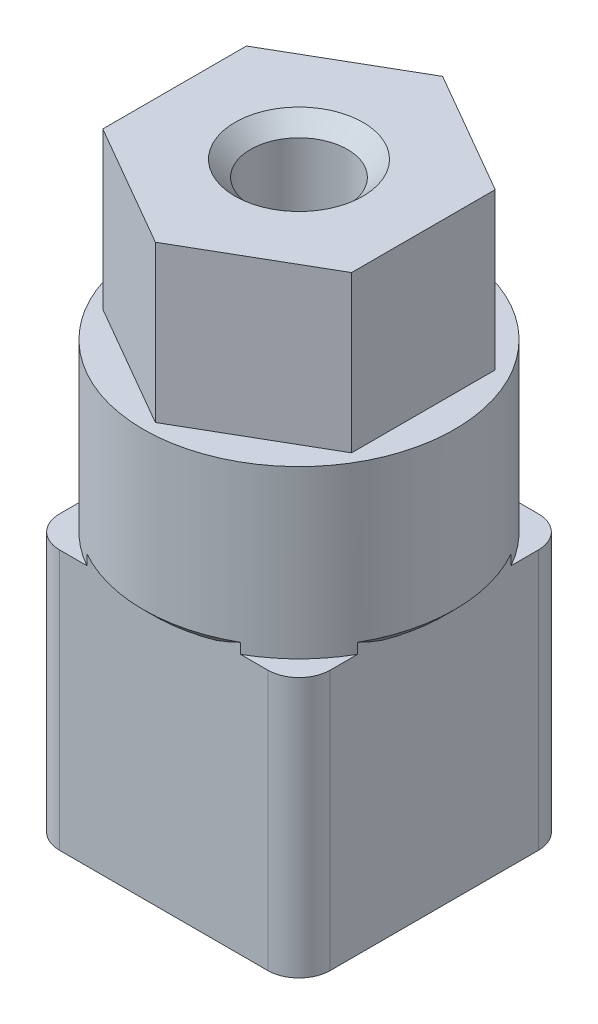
ISO-10303-21;
HEADER;
FILE_DESCRIPTION(('STEP AP214'),'2;1');
FILE_NAME('part.step','',(''),(''),'','','');
FILE_SCHEMA(('AUTOMOTIVE_DESIGN { 1 0 10303 214 1 1 1 1 }'));
ENDSEC;
DATA;
#1=APPLICATION_CONTEXT('core data for automotive mechanical design processes');
#2=APPLICATION_PROTOCOL_DEFINITION('international standard','automotive_design',2000,#1);
#3=PRODUCT_CONTEXT('',#1,'mechanical');
#4=PRODUCT('Part','Part','',(#3));
#5=PRODUCT_RELATED_PRODUCT_CATEGORY('part','',(#4));
#6=PRODUCT_DEFINITION_FORMATION('','',#4);
#7=PRODUCT_DEFINITION_CONTEXT('part definition',#1,'design');
#8=PRODUCT_DEFINITION('design','',#6,#7);
#9=PRODUCT_DEFINITION_SHAPE('','',#8);
#10=(LENGTH_UNIT() NAMED_UNIT(*) SI_UNIT(.MILLI.,.METRE.));
#11=(NAMED_UNIT(*) PLANE_ANGLE_UNIT() SI_UNIT($,.RADIAN.));
#12=(NAMED_UNIT(*) SI_UNIT($,.STERADIAN.) SOLID_ANGLE_UNIT());
#13=UNCERTAINTY_MEASURE_WITH_UNIT(LENGTH_MEASURE(1.E-05),#10,'distance_accuracy_value','');
#14=(GEOMETRIC_REPRESENTATION_CONTEXT(3) GLOBAL_UNCERTAINTY_ASSIGNED_CONTEXT((#13)) GLOBAL_UNIT_ASSIGNED_CONTEXT((#10,
#11,#12)) REPRESENTATION_CONTEXT('',''));
#15=CARTESIAN_POINT('',(0.,0.,0.));
#16=DIRECTION('',(0.,0.,1.));
#17=DIRECTION('',(1.,0.,0.));
#18=AXIS2_PLACEMENT_3D('',#15,#16,#17);
#19=CARTESIAN_POINT('',(0.,41.,0.));
#20=DIRECTION('',(0.,1.,0.));
#21=DIRECTION('',(0.,0.,1.));
#22=AXIS2_PLACEMENT_3D('',#19,#20,#21);
#23=PLANE('',#22);
#24=CARTESIAN_POINT('',(0.,41.,0.));
#25=DIRECTION('',(0.,1.,0.));
#26=DIRECTION('',(0.,0.,1.));
#27=AXIS2_PLACEMENT_3D('',#24,#25,#26);
#28=CIRCLE('',#27,14.95);
#29=CARTESIAN_POINT('',(0.,41.,14.95));
#30=VERTEX_POINT('',#29);
#31=EDGE_CURVE('E248',#30,#30,#28,.T.);
#32=ORIENTED_EDGE('',*,*,#31,.T.);
#33=EDGE_LOOP('',(#32));
#34=FACE_BOUND('',#33,.T.);
#35=DIRECTION('',(-0.866025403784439,0.,0.5));
#36=VECTOR('',#35,1.);
#37=CARTESIAN_POINT('',(0.,41.,-13.7986714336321));
#38=LINE('',#37,#36);
#39=CARTESIAN_POINT('',(0.,41.,-13.7986714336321));
#40=VERTEX_POINT('',#39);
#41=CARTESIAN_POINT('',(-11.95,41.,-6.89933571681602));
#42=VERTEX_POINT('',#41);
#43=EDGE_CURVE('E639',#40,#42,#38,.T.);
#44=ORIENTED_EDGE('',*,*,#43,.F.);
#45=DIRECTION('',(-0.866025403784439,0.,-0.5));
#46=VECTOR('',#45,1.);
#47=CARTESIAN_POINT('',(11.95,41.,-6.89933571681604));
#48=LINE('',#47,#46);
#49=CARTESIAN_POINT('',(11.95,41.,-6.89933571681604));
#50=VERTEX_POINT('',#49);
#51=EDGE_CURVE('E240',#50,#40,#48,.T.);
#52=ORIENTED_EDGE('',*,*,#51,.F.);
#53=DIRECTION('',(0.,0.,-1.));
#54=VECTOR('',#53,1.);
#55=CARTESIAN_POINT('',(11.95,41.,6.89933571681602));
#56=LINE('',#55,#54);
#57=CARTESIAN_POINT('',(11.95,41.,6.89933571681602));
#58=VERTEX_POINT('',#57);
#59=EDGE_CURVE('E236',#58,#50,#56,.T.);
#60=ORIENTED_EDGE('',*,*,#59,.F.);
#61=DIRECTION('',(0.866025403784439,0.,-0.5));
#62=VECTOR('',#61,1.);
#63=CARTESIAN_POINT('',(0.,41.,13.798671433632));
#64=LINE('',#63,#62);
#65=CARTESIAN_POINT('',(0.,41.,13.798671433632));
#66=VERTEX_POINT('',#65);
#67=EDGE_CURVE('E666',#66,#58,#64,.T.);
#68=ORIENTED_EDGE('',*,*,#67,.F.);
#69=DIRECTION('',(0.866025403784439,0.,0.5));
#70=VECTOR('',#69,1.);
#71=CARTESIAN_POINT('',(-11.95,41.,6.89933571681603));
#72=LINE('',#71,#70);
#73=CARTESIAN_POINT('',(-11.95,41.,6.89933571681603));
#74=VERTEX_POINT('',#73);
#75=EDGE_CURVE('E658',#74,#66,#72,.T.);
#76=ORIENTED_EDGE('',*,*,#75,.F.);
#77=DIRECTION('',(0.,0.,1.));
#78=VECTOR('',#77,1.);
#79=CARTESIAN_POINT('',(-11.95,41.,-6.89933571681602));
#80=LINE('',#79,#78);
#81=EDGE_CURVE('E663',#42,#74,#80,.T.);
#82=ORIENTED_EDGE('',*,*,#81,.F.);
#83=EDGE_LOOP('',(#44,#52,#60,#68,#76,#82));
#84=FACE_BOUND('',#83,.T.);
#85=ADVANCED_FACE('F36',(#34,#84),#23,.T.);
#86=CARTESIAN_POINT('',(9.99999999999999,25.,9.99999999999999));
#87=DIRECTION('',(0.,1.,0.));
#88=DIRECTION('',(0.,0.,1.));
#89=AXIS2_PLACEMENT_3D('',#86,#87,#88);
#90=PLANE('',#89);
#91=CARTESIAN_POINT('',(0.,25.,0.));
#92=DIRECTION('',(0.,1.,0.));
#93=DIRECTION('',(0.,0.,1.));
#94=AXIS2_PLACEMENT_3D('',#91,#92,#93);
#95=CIRCLE('',#94,14.95);
#96=CARTESIAN_POINT('',(7.38258084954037,25.,13.));
#97=VERTEX_POINT('',#96);
#98=CARTESIAN_POINT('',(13.,25.,7.38258084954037));
#99=VERTEX_POINT('',#98);
#100=EDGE_CURVE('E243',#97,#99,#95,.T.);
#101=ORIENTED_EDGE('',*,*,#100,.F.);
#102=DIRECTION('',(1.,0.,0.));
#103=VECTOR('',#102,1.);
#104=CARTESIAN_POINT('',(9.99999999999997,25.,13.));
#105=LINE('',#104,#103);
#106=CARTESIAN_POINT('',(9.99999999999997,25.,13.));
#107=VERTEX_POINT('',#106);
#108=EDGE_CURVE('E293',#97,#107,#105,.T.);
#109=ORIENTED_EDGE('',*,*,#108,.T.);
#110=CARTESIAN_POINT('',(9.99999999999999,25.,9.99999999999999));
#111=DIRECTION('',(0.,1.,0.));
#112=DIRECTION('',(0.,0.,1.));
#113=AXIS2_PLACEMENT_3D('',#110,#111,#112);
#114=CIRCLE('',#113,3.);
#115=CARTESIAN_POINT('',(13.,25.,9.99999999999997));
#116=VERTEX_POINT('',#115);
#117=EDGE_CURVE('E261',#107,#116,#114,.T.);
#118=ORIENTED_EDGE('',*,*,#117,.T.);
#119=DIRECTION('',(0.,0.,-1.));
#120=VECTOR('',#119,1.);
#121=CARTESIAN_POINT('',(13.,25.,9.99999999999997));
#122=LINE('',#121,#120);
#123=EDGE_CURVE('E267',#116,#99,#122,.T.);
#124=ORIENTED_EDGE('',*,*,#123,.T.);
#125=EDGE_LOOP('',(#101,#109,#118,#124));
#126=FACE_BOUND('',#125,.T.);
#127=ADVANCED_FACE('F519',(#126),#90,.T.);
#128=CARTESIAN_POINT('',(13.,25.,-7.38258084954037));
#129=VERTEX_POINT('',#128);
#130=CARTESIAN_POINT('',(7.38258084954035,25.,-13.));
#131=VERTEX_POINT('',#130);
#132=EDGE_CURVE('E250',#129,#131,#95,.T.);
#133=ORIENTED_EDGE('',*,*,#132,.F.);
#134=CARTESIAN_POINT('',(13.,25.,-9.99999999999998));
#135=VERTEX_POINT('',#134);
#136=EDGE_CURVE('E265',#129,#135,#122,.T.);
#137=ORIENTED_EDGE('',*,*,#136,.T.);
#138=CARTESIAN_POINT('',(9.99999999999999,25.,-10.));
#139=DIRECTION('',(0.,1.,0.));
#140=DIRECTION('',(0.,0.,1.));
#141=AXIS2_PLACEMENT_3D('',#138,#139,#140);
#142=CIRCLE('',#141,3.);
#143=CARTESIAN_POINT('',(9.99999999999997,25.,-13.));
#144=VERTEX_POINT('',#143);
#145=EDGE_CURVE('E271',#135,#144,#142,.T.);
#146=ORIENTED_EDGE('',*,*,#145,.T.);
#147=DIRECTION('',(-1.,0.,0.));
#148=VECTOR('',#147,1.);
#149=CARTESIAN_POINT('',(9.99999999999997,25.,-13.));
#150=LINE('',#149,#148);
#151=EDGE_CURVE('E276',#144,#131,#150,.T.);
#152=ORIENTED_EDGE('',*,*,#151,.T.);
#153=EDGE_LOOP('',(#133,#137,#146,#152));
#154=FACE_BOUND('',#153,.T.);
#155=ADVANCED_FACE('F525',(#154),#90,.T.);
#156=CARTESIAN_POINT('',(-7.38258084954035,25.,-13.));
#157=VERTEX_POINT('',#156);
#158=CARTESIAN_POINT('',(-13.,25.,-7.38258084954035));
#159=VERTEX_POINT('',#158);
#160=EDGE_CURVE('E607',#157,#159,#95,.T.);
#161=ORIENTED_EDGE('',*,*,#160,.F.);
#162=CARTESIAN_POINT('',(-9.99999999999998,25.,-13.));
#163=VERTEX_POINT('',#162);
#164=EDGE_CURVE('E275',#157,#163,#150,.T.);
#165=ORIENTED_EDGE('',*,*,#164,.T.);
#166=CARTESIAN_POINT('',(-10.,25.,-10.));
#167=DIRECTION('',(0.,1.,0.));
#168=DIRECTION('',(0.,0.,1.));
#169=AXIS2_PLACEMENT_3D('',#166,#167,#168);
#170=CIRCLE('',#169,3.);
#171=CARTESIAN_POINT('',(-13.,25.,-9.99999999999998));
#172=VERTEX_POINT('',#171);
#173=EDGE_CURVE('E280',#163,#172,#170,.T.);
#174=ORIENTED_EDGE('',*,*,#173,.T.);
#175=DIRECTION('',(0.,0.,1.));
#176=VECTOR('',#175,1.);
#177=CARTESIAN_POINT('',(-13.,25.,9.99999999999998));
#178=LINE('',#177,#176);
#179=EDGE_CURVE('E285',#172,#159,#178,.T.);
#180=ORIENTED_EDGE('',*,*,#179,.T.);
#181=EDGE_LOOP('',(#161,#165,#174,#180));
#182=FACE_BOUND('',#181,.T.);
#183=ADVANCED_FACE('F503',(#182),#90,.T.);
#184=CARTESIAN_POINT('',(9.99999999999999,25.,9.99999999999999));
#185=DIRECTION('',(0.,-1.,0.));
#186=DIRECTION('',(0.,0.,-1.));
#187=AXIS2_PLACEMENT_3D('',#184,#185,#186);
#188=CYLINDRICAL_SURFACE('',#187,3.);
#189=CARTESIAN_POINT('',(9.99999999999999,0.,9.99999999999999));
#190=DIRECTION('',(0.,1.,0.));
#191=DIRECTION('',(0.,0.,1.));
#192=AXIS2_PLACEMENT_3D('',#189,#190,#191);
#193=CIRCLE('',#192,3.);
#194=CARTESIAN_POINT('',(9.99999999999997,0.,13.));
#195=VERTEX_POINT('',#194);
#196=CARTESIAN_POINT('',(13.,0.,9.99999999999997));
#197=VERTEX_POINT('',#196);
#198=EDGE_CURVE('E259',#195,#197,#193,.T.);
#199=ORIENTED_EDGE('',*,*,#198,.T.);
#200=DIRECTION('',(0.,-1.,0.));
#201=VECTOR('',#200,1.);
#202=CARTESIAN_POINT('',(13.,25.,9.99999999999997));
#203=LINE('',#202,#201);
#204=EDGE_CURVE('E348',#116,#197,#203,.T.);
#205=ORIENTED_EDGE('',*,*,#204,.F.);
#206=ORIENTED_EDGE('',*,*,#117,.F.);
#207=DIRECTION('',(0.,-1.,0.));
#208=VECTOR('',#207,1.);
#209=CARTESIAN_POINT('',(9.99999999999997,25.,13.));
#210=LINE('',#209,#208);
#211=EDGE_CURVE('E298',#107,#195,#210,.T.);
#212=ORIENTED_EDGE('',*,*,#211,.T.);
#213=EDGE_LOOP('',(#199,#205,#206,#212));
#214=FACE_BOUND('',#213,.T.);
#215=ADVANCED_FACE('F500',(#214),#188,.T.);
#216=CARTESIAN_POINT('',(13.,25.,9.99999999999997));
#217=DIRECTION('',(-1.,0.,0.));
#218=DIRECTION('',(0.,0.,1.));
#219=AXIS2_PLACEMENT_3D('',#216,#217,#218);
#220=PLANE('',#219);
#221=DIRECTION('',(0.,0.,-1.));
#222=VECTOR('',#221,1.);
#223=CARTESIAN_POINT('',(13.,0.,9.99999999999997));
#224=LINE('',#223,#222);
#225=CARTESIAN_POINT('',(13.,0.,-9.99999999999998));
#226=VERTEX_POINT('',#225);
#227=EDGE_CURVE('E303',#197,#226,#224,.T.);
#228=ORIENTED_EDGE('',*,*,#227,.T.);
#229=DIRECTION('',(0.,-1.,0.));
#230=VECTOR('',#229,1.);
#231=CARTESIAN_POINT('',(13.,25.,-9.99999999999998));
#232=LINE('',#231,#230);
#233=EDGE_CURVE('E344',#135,#226,#232,.T.);
#234=ORIENTED_EDGE('',*,*,#233,.F.);
#235=ORIENTED_EDGE('',*,*,#136,.F.);
#236=DIRECTION('',(0.,-1.,0.));
#237=VECTOR('',#236,1.);
#238=CARTESIAN_POINT('',(13.,26.,-7.38258084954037));
#239=LINE('',#238,#237);
#240=CARTESIAN_POINT('',(13.,26.,-7.38258084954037));
#241=VERTEX_POINT('',#240);
#242=EDGE_CURVE('E374',#241,#129,#239,.T.);
#243=ORIENTED_EDGE('',*,*,#242,.F.);
#244=CARTESIAN_POINT('',(13.,26.,-7.38258084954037));
#245=CARTESIAN_POINT('',(13.,25.9066217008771,-7.19347367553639));
#246=CARTESIAN_POINT('',(13.,25.8154092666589,-7.00328340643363));
#247=CARTESIAN_POINT('',(13.,25.6378848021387,-6.62080821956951));
#248=CARTESIAN_POINT('',(13.,25.5515690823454,-6.4285250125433));
#249=CARTESIAN_POINT('',(13.,25.3842553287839,-6.04163013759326));
#250=CARTESIAN_POINT('',(13.,25.3032577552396,-5.84701826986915));
#251=CARTESIAN_POINT('',(13.,25.147093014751,-5.45529957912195));
#252=CARTESIAN_POINT('',(13.,25.0719303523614,-5.2581909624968));
#253=CARTESIAN_POINT('',(13.,25.,-5.05989130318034));
#254=B_SPLINE_CURVE_WITH_KNOTS('',3,(#244,#245,#246,#247,#248,#249,#250,#251,#252,#253),
.UNSPECIFIED.,.F.,.F.,(4,2,2,2,4),(0.,0.632719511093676,1.26495578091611,1.89724669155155,
2.53002097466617),.UNSPECIFIED.);
#255=CARTESIAN_POINT('',(13.,25.,-5.05989130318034));
#256=VERTEX_POINT('',#255);
#257=EDGE_CURVE('E50',#241,#256,#254,.T.);
#258=ORIENTED_EDGE('',*,*,#257,.T.);
#259=CARTESIAN_POINT('',(13.,25.,5.05989130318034));
#260=VERTEX_POINT('',#259);
#261=EDGE_CURVE('E272',#260,#256,#122,.T.);
#262=ORIENTED_EDGE('',*,*,#261,.F.);
#263=CARTESIAN_POINT('',(13.,25.,5.05989130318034));
#264=CARTESIAN_POINT('',(13.,25.0719303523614,5.2581909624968));
#265=CARTESIAN_POINT('',(13.,25.147093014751,5.45529957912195));
#266=CARTESIAN_POINT('',(13.,25.3032577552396,5.84701826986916));
#267=CARTESIAN_POINT('',(13.,25.3842553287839,6.04163013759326));
#268=CARTESIAN_POINT('',(13.,25.5515690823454,6.4285250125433));
#269=CARTESIAN_POINT('',(13.,25.6378848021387,6.62080821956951));
#270=CARTESIAN_POINT('',(13.,25.8154092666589,7.00328340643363));
#271=CARTESIAN_POINT('',(13.,25.9066217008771,7.19347367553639));
#272=CARTESIAN_POINT('',(13.,26.,7.38258084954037));
#273=B_SPLINE_CURVE_WITH_KNOTS('',3,(#263,#264,#265,#266,#267,#268,#269,#270,#271,#272),
.UNSPECIFIED.,.F.,.F.,(4,2,2,2,4),(0.,0.632774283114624,1.26506519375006,1.89730146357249,
2.53002097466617),.UNSPECIFIED.);
#274=CARTESIAN_POINT('',(13.,26.,7.38258084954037));
#275=VERTEX_POINT('',#274);
#276=EDGE_CURVE('E11',#260,#275,#273,.T.);
#277=ORIENTED_EDGE('',*,*,#276,.T.);
#278=DIRECTION('',(0.,-1.,0.));
#279=VECTOR('',#278,1.);
#280=CARTESIAN_POINT('',(13.,25.,7.38258084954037));
#281=LINE('',#280,#279);
#282=EDGE_CURVE('E56',#99,#275,#281,.F.);
#283=ORIENTED_EDGE('',*,*,#282,.F.);
#284=ORIENTED_EDGE('',*,*,#123,.F.);
#285=ORIENTED_EDGE('',*,*,#204,.T.);
#286=EDGE_LOOP('',(#228,#234,#235,#243,#258,#262,#277,#283,#284,#285));
#287=FACE_BOUND('',#286,.T.);
#288=ADVANCED_FACE('F496',(#287),#220,.F.);
#289=CARTESIAN_POINT('',(9.99999999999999,25.,-10.));
#290=DIRECTION('',(0.,-1.,0.));
#291=DIRECTION('',(0.,0.,-1.));
#292=AXIS2_PLACEMENT_3D('',#289,#290,#291);
#293=CYLINDRICAL_SURFACE('',#292,3.);
#294=CARTESIAN_POINT('',(9.99999999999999,0.,-10.));
#295=DIRECTION('',(0.,1.,0.));
#296=DIRECTION('',(0.,0.,1.));
#297=AXIS2_PLACEMENT_3D('',#294,#295,#296);
#298=CIRCLE('',#297,3.);
#299=CARTESIAN_POINT('',(9.99999999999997,0.,-13.));
#300=VERTEX_POINT('',#299);
#301=EDGE_CURVE('E305',#226,#300,#298,.T.);
#302=ORIENTED_EDGE('',*,*,#301,.T.);
#303=DIRECTION('',(0.,-1.,0.));
#304=VECTOR('',#303,1.);
#305=CARTESIAN_POINT('',(9.99999999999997,25.,-13.));
#306=LINE('',#305,#304);
#307=EDGE_CURVE('E340',#144,#300,#306,.T.);
#308=ORIENTED_EDGE('',*,*,#307,.F.);
#309=ORIENTED_EDGE('',*,*,#145,.F.);
#310=ORIENTED_EDGE('',*,*,#233,.T.);
#311=EDGE_LOOP('',(#302,#308,#309,#310));
#312=FACE_BOUND('',#311,.T.);
#313=ADVANCED_FACE('F485',(#312),#293,.T.);
#314=CARTESIAN_POINT('',(9.99999999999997,25.,-13.));
#315=DIRECTION('',(0.,0.,1.));
#316=DIRECTION('',(1.,0.,0.));
#317=AXIS2_PLACEMENT_3D('',#314,#315,#316);
#318=PLANE('',#317);
#319=DIRECTION('',(-1.,0.,0.));
#320=VECTOR('',#319,1.);
#321=CARTESIAN_POINT('',(9.99999999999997,0.,-13.));
#322=LINE('',#321,#320);
#323=CARTESIAN_POINT('',(-9.99999999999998,0.,-13.));
#324=VERTEX_POINT('',#323);
#325=EDGE_CURVE('E308',#300,#324,#322,.T.);
#326=ORIENTED_EDGE('',*,*,#325,.T.);
#327=DIRECTION('',(0.,-1.,0.));
#328=VECTOR('',#327,1.);
#329=CARTESIAN_POINT('',(-9.99999999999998,25.,-13.));
#330=LINE('',#329,#328);
#331=EDGE_CURVE('E336',#163,#324,#330,.T.);
#332=ORIENTED_EDGE('',*,*,#331,.F.);
#333=ORIENTED_EDGE('',*,*,#164,.F.);
#334=DIRECTION('',(0.,-1.,0.));
#335=VECTOR('',#334,1.);
#336=CARTESIAN_POINT('',(-7.38258084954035,26.,-13.));
#337=LINE('',#336,#335);
#338=CARTESIAN_POINT('',(-7.38258084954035,26.,-13.));
#339=VERTEX_POINT('',#338);
#340=EDGE_CURVE('E383',#339,#157,#337,.T.);
#341=ORIENTED_EDGE('',*,*,#340,.F.);
#342=CARTESIAN_POINT('',(-7.38258084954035,26.,-13.));
#343=CARTESIAN_POINT('',(-7.19347367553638,25.9066217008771,-13.));
#344=CARTESIAN_POINT('',(-7.00328340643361,25.8154092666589,-13.));
#345=CARTESIAN_POINT('',(-6.62080821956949,25.6378848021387,-13.));
#346=CARTESIAN_POINT('',(-6.42852501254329,25.5515690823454,-13.));
#347=CARTESIAN_POINT('',(-6.04163013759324,25.3842553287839,-13.));
#348=CARTESIAN_POINT('',(-5.84701826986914,25.3032577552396,-13.));
#349=CARTESIAN_POINT('',(-5.45529957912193,25.147093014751,-13.));
#350=CARTESIAN_POINT('',(-5.25819096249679,25.0719303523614,-13.));
#351=CARTESIAN_POINT('',(-5.05989130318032,25.,-13.));
#352=B_SPLINE_CURVE_WITH_KNOTS('',3,(#342,#343,#344,#345,#346,#347,#348,#349,#350,#351),
.UNSPECIFIED.,.F.,.F.,(4,2,2,2,4),(0.,0.632719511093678,1.26495578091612,1.89724669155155,
2.53002097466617),.UNSPECIFIED.);
#353=CARTESIAN_POINT('',(-5.05989130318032,25.,-13.));
#354=VERTEX_POINT('',#353);
#355=EDGE_CURVE('E465',#339,#354,#352,.T.);
#356=ORIENTED_EDGE('',*,*,#355,.T.);
#357=CARTESIAN_POINT('',(5.05989130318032,25.,-13.));
#358=VERTEX_POINT('',#357);
#359=EDGE_CURVE('E281',#358,#354,#150,.T.);
#360=ORIENTED_EDGE('',*,*,#359,.F.);
#361=CARTESIAN_POINT('',(5.05989130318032,25.,-13.));
#362=CARTESIAN_POINT('',(5.25819096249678,25.0719303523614,-13.));
#363=CARTESIAN_POINT('',(5.45529957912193,25.147093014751,-13.));
#364=CARTESIAN_POINT('',(5.84701826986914,25.3032577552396,-13.));
#365=CARTESIAN_POINT('',(6.04163013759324,25.3842553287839,-13.));
#366=CARTESIAN_POINT('',(6.42852501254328,25.5515690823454,-13.));
#367=CARTESIAN_POINT('',(6.62080821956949,25.6378848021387,-13.));
#368=CARTESIAN_POINT('',(7.00328340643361,25.8154092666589,-13.));
#369=CARTESIAN_POINT('',(7.19347367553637,25.9066217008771,-13.));
#370=CARTESIAN_POINT('',(7.38258084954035,26.,-13.));
#371=B_SPLINE_CURVE_WITH_KNOTS('',3,(#361,#362,#363,#364,#365,#366,#367,#368,#369,#370),
.UNSPECIFIED.,.F.,.F.,(4,2,2,2,4),(0.,0.632774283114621,1.26506519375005,1.89730146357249,
2.53002097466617),.UNSPECIFIED.);
#372=CARTESIAN_POINT('',(7.38258084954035,26.,-13.));
#373=VERTEX_POINT('',#372);
#374=EDGE_CURVE('E487',#358,#373,#371,.T.);
#375=ORIENTED_EDGE('',*,*,#374,.T.);
#376=DIRECTION('',(0.,-1.,0.));
#377=VECTOR('',#376,1.);
#378=CARTESIAN_POINT('',(7.38258084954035,25.,-13.));
#379=LINE('',#378,#377);
#380=EDGE_CURVE('E64',#131,#373,#379,.F.);
#381=ORIENTED_EDGE('',*,*,#380,.F.);
#382=ORIENTED_EDGE('',*,*,#151,.F.);
#383=ORIENTED_EDGE('',*,*,#307,.T.);
#384=EDGE_LOOP('',(#326,#332,#333,#341,#356,#360,#375,#381,#382,#383));
#385=FACE_BOUND('',#384,.T.);
#386=ADVANCED_FACE('F480',(#385),#318,.F.);
#387=CARTESIAN_POINT('',(-10.,25.,-10.));
#388=DIRECTION('',(0.,-1.,0.));
#389=DIRECTION('',(0.,0.,-1.));
#390=AXIS2_PLACEMENT_3D('',#387,#388,#389);
#391=CYLINDRICAL_SURFACE('',#390,3.);
#392=CARTESIAN_POINT('',(-10.,0.,-10.));
#393=DIRECTION('',(0.,1.,0.));
#394=DIRECTION('',(0.,0.,1.));
#395=AXIS2_PLACEMENT_3D('',#392,#393,#394);
#396=CIRCLE('',#395,3.);
#397=CARTESIAN_POINT('',(-13.,0.,-9.99999999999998));
#398=VERTEX_POINT('',#397);
#399=EDGE_CURVE('E311',#324,#398,#396,.T.);
#400=ORIENTED_EDGE('',*,*,#399,.T.);
#401=DIRECTION('',(0.,-1.,0.));
#402=VECTOR('',#401,1.);
#403=CARTESIAN_POINT('',(-13.,25.,-9.99999999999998));
#404=LINE('',#403,#402);
#405=EDGE_CURVE('E332',#172,#398,#404,.T.);
#406=ORIENTED_EDGE('',*,*,#405,.F.);
#407=ORIENTED_EDGE('',*,*,#173,.F.);
#408=ORIENTED_EDGE('',*,*,#331,.T.);
#409=EDGE_LOOP('',(#400,#406,#407,#408));
#410=FACE_BOUND('',#409,.T.);
#411=ADVANCED_FACE('F476',(#410),#391,.T.);
#412=CARTESIAN_POINT('',(-13.,25.,9.99999999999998));
#413=DIRECTION('',(1.,0.,0.));
#414=DIRECTION('',(0.,0.,-1.));
#415=AXIS2_PLACEMENT_3D('',#412,#413,#414);
#416=PLANE('',#415);
#417=DIRECTION('',(0.,0.,1.));
#418=VECTOR('',#417,1.);
#419=CARTESIAN_POINT('',(-13.,0.,9.99999999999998));
#420=LINE('',#419,#418);
#421=CARTESIAN_POINT('',(-13.,0.,9.99999999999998));
#422=VERTEX_POINT('',#421);
#423=EDGE_CURVE('E314',#398,#422,#420,.T.);
#424=ORIENTED_EDGE('',*,*,#423,.T.);
#425=DIRECTION('',(0.,-1.,0.));
#426=VECTOR('',#425,1.);
#427=CARTESIAN_POINT('',(-13.,25.,9.99999999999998));
#428=LINE('',#427,#426);
#429=CARTESIAN_POINT('',(-13.,25.,9.99999999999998));
#430=VERTEX_POINT('',#429);
#431=EDGE_CURVE('E328',#430,#422,#428,.T.);
#432=ORIENTED_EDGE('',*,*,#431,.F.);
#433=CARTESIAN_POINT('',(-13.,25.,7.38258084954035));
#434=VERTEX_POINT('',#433);
#435=EDGE_CURVE('E284',#434,#430,#178,.T.);
#436=ORIENTED_EDGE('',*,*,#435,.F.);
#437=DIRECTION('',(0.,-1.,0.));
#438=VECTOR('',#437,1.);
#439=CARTESIAN_POINT('',(-13.,26.,7.38258084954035));
#440=LINE('',#439,#438);
#441=CARTESIAN_POINT('',(-13.,26.,7.38258084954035));
#442=VERTEX_POINT('',#441);
#443=EDGE_CURVE('E394',#442,#434,#440,.T.);
#444=ORIENTED_EDGE('',*,*,#443,.F.);
#445=CARTESIAN_POINT('',(-13.,26.,7.38258084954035));
#446=CARTESIAN_POINT('',(-13.,25.9066217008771,7.19347367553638));
#447=CARTESIAN_POINT('',(-13.,25.8154092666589,7.00328340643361));
#448=CARTESIAN_POINT('',(-13.,25.6378848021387,6.62080821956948));
#449=CARTESIAN_POINT('',(-13.,25.5515690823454,6.42852501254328));
#450=CARTESIAN_POINT('',(-13.,25.3842553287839,6.04163013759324));
#451=CARTESIAN_POINT('',(-13.,25.3032577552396,5.84701826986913));
#452=CARTESIAN_POINT('',(-13.,25.147093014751,5.45529957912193));
#453=CARTESIAN_POINT('',(-13.,25.0719303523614,5.25819096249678));
#454=CARTESIAN_POINT('',(-13.,25.,5.05989130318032));
#455=B_SPLINE_CURVE_WITH_KNOTS('',3,(#445,#446,#447,#448,#449,#450,#451,#452,#453,#454),
.UNSPECIFIED.,.F.,.F.,(4,2,2,2,4),(0.,0.63271951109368,1.26495578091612,1.89724669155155,
2.53002097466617),.UNSPECIFIED.);
#456=CARTESIAN_POINT('',(-13.,25.,5.05989130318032));
#457=VERTEX_POINT('',#456);
#458=EDGE_CURVE('E453',#442,#457,#455,.T.);
#459=ORIENTED_EDGE('',*,*,#458,.T.);
#460=CARTESIAN_POINT('',(-13.,25.,-5.05989130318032));
#461=VERTEX_POINT('',#460);
#462=EDGE_CURVE('E290',#461,#457,#178,.T.);
#463=ORIENTED_EDGE('',*,*,#462,.F.);
#464=CARTESIAN_POINT('',(-13.,25.,-5.05989130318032));
#465=CARTESIAN_POINT('',(-13.,25.0719303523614,-5.25819096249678));
#466=CARTESIAN_POINT('',(-13.,25.147093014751,-5.45529957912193));
#467=CARTESIAN_POINT('',(-13.,25.3032577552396,-5.84701826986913));
#468=CARTESIAN_POINT('',(-13.,25.3842553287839,-6.04163013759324));
#469=CARTESIAN_POINT('',(-13.,25.5515690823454,-6.42852501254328));
#470=CARTESIAN_POINT('',(-13.,25.6378848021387,-6.62080821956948));
#471=CARTESIAN_POINT('',(-13.,25.8154092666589,-7.00328340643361));
#472=CARTESIAN_POINT('',(-13.,25.9066217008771,-7.19347367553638));
#473=CARTESIAN_POINT('',(-13.,26.,-7.38258084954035));
#474=B_SPLINE_CURVE_WITH_KNOTS('',3,(#464,#465,#466,#467,#468,#469,#470,#471,#472,#473),
.UNSPECIFIED.,.F.,.F.,(4,2,2,2,4),(0.,0.632774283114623,1.26506519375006,1.89730146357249,
2.53002097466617),.UNSPECIFIED.);
#475=CARTESIAN_POINT('',(-13.,26.,-7.38258084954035));
#476=VERTEX_POINT('',#475);
#477=EDGE_CURVE('E459',#461,#476,#474,.T.);
#478=ORIENTED_EDGE('',*,*,#477,.T.);
#479=DIRECTION('',(0.,-1.,0.));
#480=VECTOR('',#479,1.);
#481=CARTESIAN_POINT('',(-13.,25.,-7.38258084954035));
#482=LINE('',#481,#480);
#483=EDGE_CURVE('E386',#159,#476,#482,.F.);
#484=ORIENTED_EDGE('',*,*,#483,.F.);
#485=ORIENTED_EDGE('',*,*,#179,.F.);
#486=ORIENTED_EDGE('',*,*,#405,.T.);
#487=EDGE_LOOP('',(#424,#432,#436,#444,#459,#463,#478,#484,#485,#486));
#488=FACE_BOUND('',#487,.T.);
#489=ADVANCED_FACE('F471',(#488),#416,.F.);
#490=CARTESIAN_POINT('',(-10.,25.,10.));
#491=DIRECTION('',(0.,-1.,0.));
#492=DIRECTION('',(0.,0.,-1.));
#493=AXIS2_PLACEMENT_3D('',#490,#491,#492);
#494=CYLINDRICAL_SURFACE('',#493,3.);
#495=CARTESIAN_POINT('',(-10.,0.,10.));
#496=DIRECTION('',(0.,1.,0.));
#497=DIRECTION('',(0.,0.,-1.));
#498=AXIS2_PLACEMENT_3D('',#495,#496,#497);
#499=CIRCLE('',#498,3.);
#500=CARTESIAN_POINT('',(-9.99999999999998,0.,13.));
#501=VERTEX_POINT('',#500);
#502=EDGE_CURVE('E317',#422,#501,#499,.T.);
#503=ORIENTED_EDGE('',*,*,#502,.T.);
#504=DIRECTION('',(0.,-1.,0.));
#505=VECTOR('',#504,1.);
#506=CARTESIAN_POINT('',(-9.99999999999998,25.,13.));
#507=LINE('',#506,#505);
#508=CARTESIAN_POINT('',(-9.99999999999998,25.,13.));
#509=VERTEX_POINT('',#508);
#510=EDGE_CURVE('E324',#509,#501,#507,.T.);
#511=ORIENTED_EDGE('',*,*,#510,.F.);
#512=CARTESIAN_POINT('',(-10.,25.,10.));
#513=DIRECTION('',(0.,1.,0.));
#514=DIRECTION('',(0.,0.,-1.));
#515=AXIS2_PLACEMENT_3D('',#512,#513,#514);
#516=CIRCLE('',#515,3.);
#517=EDGE_CURVE('E289',#430,#509,#516,.T.);
#518=ORIENTED_EDGE('',*,*,#517,.F.);
#519=ORIENTED_EDGE('',*,*,#431,.T.);
#520=EDGE_LOOP('',(#503,#511,#518,#519));
#521=FACE_BOUND('',#520,.T.);
#522=ADVANCED_FACE('F475',(#521),#494,.T.);
#523=CARTESIAN_POINT('',(9.99999999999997,25.,13.));
#524=DIRECTION('',(0.,0.,-1.));
#525=DIRECTION('',(-1.,0.,0.));
#526=AXIS2_PLACEMENT_3D('',#523,#524,#525);
#527=PLANE('',#526);
#528=DIRECTION('',(1.,0.,0.));
#529=VECTOR('',#528,1.);
#530=CARTESIAN_POINT('',(9.99999999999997,0.,13.));
#531=LINE('',#530,#529);
#532=EDGE_CURVE('E266',#501,#195,#531,.T.);
#533=ORIENTED_EDGE('',*,*,#532,.T.);
#534=ORIENTED_EDGE('',*,*,#211,.F.);
#535=ORIENTED_EDGE('',*,*,#108,.F.);
#536=DIRECTION('',(0.,-1.,0.));
#537=VECTOR('',#536,1.);
#538=CARTESIAN_POINT('',(7.38258084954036,26.,13.));
#539=LINE('',#538,#537);
#540=CARTESIAN_POINT('',(7.38258084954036,26.,13.));
#541=VERTEX_POINT('',#540);
#542=EDGE_CURVE('E405',#541,#97,#539,.T.);
#543=ORIENTED_EDGE('',*,*,#542,.F.);
#544=CARTESIAN_POINT('',(7.38258084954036,26.,13.));
#545=CARTESIAN_POINT('',(7.19347367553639,25.9066217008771,13.));
#546=CARTESIAN_POINT('',(7.00328340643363,25.8154092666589,13.));
#547=CARTESIAN_POINT('',(6.62080821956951,25.6378848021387,13.));
#548=CARTESIAN_POINT('',(6.4285250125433,25.5515690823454,13.));
#549=CARTESIAN_POINT('',(6.04163013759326,25.3842553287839,13.));
#550=CARTESIAN_POINT('',(5.84701826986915,25.3032577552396,13.));
#551=CARTESIAN_POINT('',(5.45529957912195,25.147093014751,13.));
#552=CARTESIAN_POINT('',(5.2581909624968,25.0719303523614,13.));
#553=CARTESIAN_POINT('',(5.05989130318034,25.,13.));
#554=B_SPLINE_CURVE_WITH_KNOTS('',3,(#544,#545,#546,#547,#548,#549,#550,#551,#552,#553),
.UNSPECIFIED.,.F.,.F.,(4,2,2,2,4),(0.,0.632719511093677,1.26495578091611,1.89724669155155,
2.53002097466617),.UNSPECIFIED.);
#555=CARTESIAN_POINT('',(5.05989130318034,25.,13.));
#556=VERTEX_POINT('',#555);
#557=EDGE_CURVE('E420',#541,#556,#554,.T.);
#558=ORIENTED_EDGE('',*,*,#557,.T.);
#559=CARTESIAN_POINT('',(-5.05989130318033,25.,13.));
#560=VERTEX_POINT('',#559);
#561=EDGE_CURVE('E299',#560,#556,#105,.T.);
#562=ORIENTED_EDGE('',*,*,#561,.F.);
#563=CARTESIAN_POINT('',(-5.05989130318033,25.,13.));
#564=CARTESIAN_POINT('',(-5.2581909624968,25.0719303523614,13.));
#565=CARTESIAN_POINT('',(-5.45529957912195,25.147093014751,13.));
#566=CARTESIAN_POINT('',(-5.84701826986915,25.3032577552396,13.));
#567=CARTESIAN_POINT('',(-6.04163013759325,25.3842553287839,13.));
#568=CARTESIAN_POINT('',(-6.42852501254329,25.5515690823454,13.));
#569=CARTESIAN_POINT('',(-6.6208082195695,25.6378848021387,13.));
#570=CARTESIAN_POINT('',(-7.00328340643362,25.8154092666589,13.));
#571=CARTESIAN_POINT('',(-7.19347367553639,25.9066217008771,13.));
#572=CARTESIAN_POINT('',(-7.38258084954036,26.,13.));
#573=B_SPLINE_CURVE_WITH_KNOTS('',3,(#563,#564,#565,#566,#567,#568,#569,#570,#571,#572),
.UNSPECIFIED.,.F.,.F.,(4,2,2,2,4),(0.,0.632774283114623,1.26506519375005,1.89730146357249,
2.53002097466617),.UNSPECIFIED.);
#574=CARTESIAN_POINT('',(-7.38258084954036,26.,13.));
#575=VERTEX_POINT('',#574);
#576=EDGE_CURVE('E428',#560,#575,#573,.T.);
#577=ORIENTED_EDGE('',*,*,#576,.T.);
#578=DIRECTION('',(0.,-1.,0.));
#579=VECTOR('',#578,1.);
#580=CARTESIAN_POINT('',(-7.38258084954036,25.,13.));
#581=LINE('',#580,#579);
#582=CARTESIAN_POINT('',(-7.38258084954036,25.,13.));
#583=VERTEX_POINT('',#582);
#584=EDGE_CURVE('E397',#583,#575,#581,.F.);
#585=ORIENTED_EDGE('',*,*,#584,.F.);
#586=EDGE_CURVE('E294',#509,#583,#105,.T.);
#587=ORIENTED_EDGE('',*,*,#586,.F.);
#588=ORIENTED_EDGE('',*,*,#510,.T.);
#589=EDGE_LOOP('',(#533,#534,#535,#543,#558,#562,#577,#585,#587,#588));
#590=FACE_BOUND('',#589,.T.);
#591=ADVANCED_FACE('F433',(#590),#527,.F.);
#592=EDGE_CURVE('E251',#434,#583,#95,.T.);
#593=ORIENTED_EDGE('',*,*,#592,.F.);
#594=ORIENTED_EDGE('',*,*,#435,.T.);
#595=ORIENTED_EDGE('',*,*,#517,.T.);
#596=ORIENTED_EDGE('',*,*,#586,.T.);
#597=EDGE_LOOP('',(#593,#594,#595,#596));
#598=FACE_BOUND('',#597,.T.);
#599=ADVANCED_FACE('F528',(#598),#90,.T.);
#600=CARTESIAN_POINT('',(9.99999999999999,0.,9.99999999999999));
#601=DIRECTION('',(0.,1.,0.));
#602=DIRECTION('',(0.,0.,1.));
#603=AXIS2_PLACEMENT_3D('',#600,#601,#602);
#604=PLANE('',#603);
#605=CARTESIAN_POINT('',(0.,0.,0.));
#606=DIRECTION('',(0.,1.,0.));
#607=DIRECTION('',(0.,0.,1.));
#608=AXIS2_PLACEMENT_3D('',#605,#606,#607);
#609=CIRCLE('',#608,9.95996839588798);
#610=CARTESIAN_POINT('',(0.,0.,9.95996839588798));
#611=VERTEX_POINT('',#610);
#612=EDGE_CURVE('E360',#611,#611,#609,.T.);
#613=ORIENTED_EDGE('',*,*,#612,.T.);
#614=EDGE_LOOP('',(#613));
#615=FACE_BOUND('',#614,.T.);
#616=ORIENTED_EDGE('',*,*,#198,.F.);
#617=ORIENTED_EDGE('',*,*,#532,.F.);
#618=ORIENTED_EDGE('',*,*,#502,.F.);
#619=ORIENTED_EDGE('',*,*,#423,.F.);
#620=ORIENTED_EDGE('',*,*,#399,.F.);
#621=ORIENTED_EDGE('',*,*,#325,.F.);
#622=ORIENTED_EDGE('',*,*,#301,.F.);
#623=ORIENTED_EDGE('',*,*,#227,.F.);
#624=EDGE_LOOP('',(#616,#617,#618,#619,#620,#621,#622,#623));
#625=FACE_BOUND('',#624,.T.);
#626=ADVANCED_FACE('F537',(#615,#625),#604,.F.);
#627=CARTESIAN_POINT('',(0.,25.,0.));
#628=DIRECTION('',(0.,1.,0.));
#629=DIRECTION('',(0.,0.,1.));
#630=AXIS2_PLACEMENT_3D('',#627,#628,#629);
#631=PLANE('',#630);
#632=ORIENTED_EDGE('',*,*,#261,.T.);
#633=CARTESIAN_POINT('',(0.,25.,0.));
#634=DIRECTION('',(0.,1.,0.));
#635=DIRECTION('',(0.,0.,1.));
#636=AXIS2_PLACEMENT_3D('',#633,#634,#635);
#637=CIRCLE('',#636,13.95);
#638=EDGE_CURVE('E417',#256,#260,#637,.F.);
#639=ORIENTED_EDGE('',*,*,#638,.T.);
#640=EDGE_LOOP('',(#632,#639));
#641=FACE_BOUND('',#640,.T.);
#642=ADVANCED_FACE('F533',(#641),#631,.F.);
#643=ORIENTED_EDGE('',*,*,#359,.T.);
#644=CARTESIAN_POINT('',(0.,25.,0.));
#645=DIRECTION('',(0.,1.,0.));
#646=DIRECTION('',(0.,0.,1.));
#647=AXIS2_PLACEMENT_3D('',#644,#645,#646);
#648=CIRCLE('',#647,13.95);
#649=EDGE_CURVE('E414',#354,#358,#648,.F.);
#650=ORIENTED_EDGE('',*,*,#649,.T.);
#651=EDGE_LOOP('',(#643,#650));
#652=FACE_BOUND('',#651,.T.);
#653=ADVANCED_FACE('F536',(#652),#631,.F.);
#654=ORIENTED_EDGE('',*,*,#462,.T.);
#655=CARTESIAN_POINT('',(0.,25.,0.));
#656=DIRECTION('',(0.,1.,0.));
#657=DIRECTION('',(0.,0.,1.));
#658=AXIS2_PLACEMENT_3D('',#655,#656,#657);
#659=CIRCLE('',#658,13.95);
#660=EDGE_CURVE('E411',#457,#461,#659,.F.);
#661=ORIENTED_EDGE('',*,*,#660,.T.);
#662=EDGE_LOOP('',(#654,#661));
#663=FACE_BOUND('',#662,.T.);
#664=ADVANCED_FACE('F602',(#663),#631,.F.);
#665=ORIENTED_EDGE('',*,*,#561,.T.);
#666=CARTESIAN_POINT('',(0.,25.,0.));
#667=DIRECTION('',(0.,1.,0.));
#668=DIRECTION('',(0.,0.,1.));
#669=AXIS2_PLACEMENT_3D('',#666,#667,#668);
#670=CIRCLE('',#669,13.95);
#671=EDGE_CURVE('E408',#556,#560,#670,.F.);
#672=ORIENTED_EDGE('',*,*,#671,.T.);
#673=EDGE_LOOP('',(#665,#672));
#674=FACE_BOUND('',#673,.T.);
#675=ADVANCED_FACE('F539',(#674),#631,.F.);
#676=CARTESIAN_POINT('',(0.,41.,0.));
#677=DIRECTION('',(0.,-1.,0.));
#678=DIRECTION('',(0.,0.,-1.));
#679=AXIS2_PLACEMENT_3D('',#676,#677,#678);
#680=CYLINDRICAL_SURFACE('',#679,14.95);
#681=ORIENTED_EDGE('',*,*,#31,.F.);
#682=EDGE_LOOP('',(#681));
#683=FACE_BOUND('',#682,.T.);
#684=CARTESIAN_POINT('',(0.,26.,0.));
#685=DIRECTION('',(0.,1.,0.));
#686=DIRECTION('',(0.,0.,1.));
#687=AXIS2_PLACEMENT_3D('',#684,#685,#686);
#688=CIRCLE('',#687,14.95);
#689=EDGE_CURVE('E401',#575,#541,#688,.T.);
#690=ORIENTED_EDGE('',*,*,#689,.T.);
#691=ORIENTED_EDGE('',*,*,#542,.T.);
#692=ORIENTED_EDGE('',*,*,#100,.T.);
#693=ORIENTED_EDGE('',*,*,#282,.T.);
#694=CARTESIAN_POINT('',(0.,26.,0.));
#695=DIRECTION('',(0.,1.,0.));
#696=DIRECTION('',(0.,0.,1.));
#697=AXIS2_PLACEMENT_3D('',#694,#695,#696);
#698=CIRCLE('',#697,14.95);
#699=EDGE_CURVE('E370',#275,#241,#698,.T.);
#700=ORIENTED_EDGE('',*,*,#699,.T.);
#701=ORIENTED_EDGE('',*,*,#242,.T.);
#702=ORIENTED_EDGE('',*,*,#132,.T.);
#703=ORIENTED_EDGE('',*,*,#380,.T.);
#704=CARTESIAN_POINT('',(0.,26.,0.));
#705=DIRECTION('',(0.,1.,0.));
#706=DIRECTION('',(0.,0.,1.));
#707=AXIS2_PLACEMENT_3D('',#704,#705,#706);
#708=CIRCLE('',#707,14.95);
#709=EDGE_CURVE('E379',#373,#339,#708,.T.);
#710=ORIENTED_EDGE('',*,*,#709,.T.);
#711=ORIENTED_EDGE('',*,*,#340,.T.);
#712=ORIENTED_EDGE('',*,*,#160,.T.);
#713=ORIENTED_EDGE('',*,*,#483,.T.);
#714=CARTESIAN_POINT('',(0.,26.,0.));
#715=DIRECTION('',(0.,1.,0.));
#716=DIRECTION('',(0.,0.,1.));
#717=AXIS2_PLACEMENT_3D('',#714,#715,#716);
#718=CIRCLE('',#717,14.95);
#719=EDGE_CURVE('E390',#476,#442,#718,.T.);
#720=ORIENTED_EDGE('',*,*,#719,.T.);
#721=ORIENTED_EDGE('',*,*,#443,.T.);
#722=ORIENTED_EDGE('',*,*,#592,.T.);
#723=ORIENTED_EDGE('',*,*,#584,.T.);
#724=EDGE_LOOP('',(#690,#691,#692,#693,#700,#701,#702,#703,#710,#711,#712,#713,#720,#721,#722,#723));
#725=FACE_BOUND('',#724,.T.);
#726=ADVANCED_FACE('F540',(#683,#725),#680,.T.);
#727=CARTESIAN_POINT('',(11.95,56.,-6.89933571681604));
#728=DIRECTION('',(-0.5,0.,0.866025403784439));
#729=DIRECTION('',(0.866025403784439,0.,0.5));
#730=AXIS2_PLACEMENT_3D('',#727,#728,#729);
#731=PLANE('',#730);
#732=ORIENTED_EDGE('',*,*,#51,.T.);
#733=DIRECTION('',(0.,-1.,0.));
#734=VECTOR('',#733,1.);
#735=CARTESIAN_POINT('',(0.,56.,-13.7986714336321));
#736=LINE('',#735,#734);
#737=CARTESIAN_POINT('',(0.,56.,-13.7986714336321));
#738=VERTEX_POINT('',#737);
#739=EDGE_CURVE('E218',#738,#40,#736,.T.);
#740=ORIENTED_EDGE('',*,*,#739,.F.);
#741=DIRECTION('',(-0.866025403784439,0.,-0.5));
#742=VECTOR('',#741,1.);
#743=CARTESIAN_POINT('',(11.95,56.,-6.89933571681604));
#744=LINE('',#743,#742);
#745=CARTESIAN_POINT('',(11.95,56.,-6.89933571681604));
#746=VERTEX_POINT('',#745);
#747=EDGE_CURVE('E226',#746,#738,#744,.T.);
#748=ORIENTED_EDGE('',*,*,#747,.F.);
#749=DIRECTION('',(0.,-1.,0.));
#750=VECTOR('',#749,1.);
#751=CARTESIAN_POINT('',(11.95,56.,-6.89933571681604));
#752=LINE('',#751,#750);
#753=EDGE_CURVE('E637',#746,#50,#752,.T.);
#754=ORIENTED_EDGE('',*,*,#753,.T.);
#755=EDGE_LOOP('',(#732,#740,#748,#754));
#756=FACE_BOUND('',#755,.T.);
#757=ADVANCED_FACE('F238',(#756),#731,.F.);
#758=CARTESIAN_POINT('',(0.,56.,-13.7986714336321));
#759=DIRECTION('',(0.5,0.,0.866025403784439));
#760=DIRECTION('',(0.866025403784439,0.,-0.5));
#761=AXIS2_PLACEMENT_3D('',#758,#759,#760);
#762=PLANE('',#761);
#763=ORIENTED_EDGE('',*,*,#43,.T.);
#764=DIRECTION('',(0.,-1.,0.));
#765=VECTOR('',#764,1.);
#766=CARTESIAN_POINT('',(-11.95,56.,-6.89933571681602));
#767=LINE('',#766,#765);
#768=CARTESIAN_POINT('',(-11.95,56.,-6.89933571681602));
#769=VERTEX_POINT('',#768);
#770=EDGE_CURVE('E221',#769,#42,#767,.T.);
#771=ORIENTED_EDGE('',*,*,#770,.F.);
#772=DIRECTION('',(-0.866025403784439,0.,0.5));
#773=VECTOR('',#772,1.);
#774=CARTESIAN_POINT('',(0.,56.,-13.7986714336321));
#775=LINE('',#774,#773);
#776=EDGE_CURVE('E214',#738,#769,#775,.T.);
#777=ORIENTED_EDGE('',*,*,#776,.F.);
#778=ORIENTED_EDGE('',*,*,#739,.T.);
#779=EDGE_LOOP('',(#763,#771,#777,#778));
#780=FACE_BOUND('',#779,.T.);
#781=ADVANCED_FACE('F216',(#780),#762,.F.);
#782=CARTESIAN_POINT('',(-11.95,56.,-6.89933571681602));
#783=DIRECTION('',(1.,0.,0.));
#784=DIRECTION('',(0.,0.,-1.));
#785=AXIS2_PLACEMENT_3D('',#782,#783,#784);
#786=PLANE('',#785);
#787=ORIENTED_EDGE('',*,*,#81,.T.);
#788=DIRECTION('',(0.,-1.,0.));
#789=VECTOR('',#788,1.);
#790=CARTESIAN_POINT('',(-11.95,56.,6.89933571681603));
#791=LINE('',#790,#789);
#792=CARTESIAN_POINT('',(-11.95,56.,6.89933571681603));
#793=VERTEX_POINT('',#792);
#794=EDGE_CURVE('E253',#793,#74,#791,.T.);
#795=ORIENTED_EDGE('',*,*,#794,.F.);
#796=DIRECTION('',(0.,0.,1.));
#797=VECTOR('',#796,1.);
#798=CARTESIAN_POINT('',(-11.95,56.,-6.89933571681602));
#799=LINE('',#798,#797);
#800=EDGE_CURVE('E225',#769,#793,#799,.T.);
#801=ORIENTED_EDGE('',*,*,#800,.F.);
#802=ORIENTED_EDGE('',*,*,#770,.T.);
#803=EDGE_LOOP('',(#787,#795,#801,#802));
#804=FACE_BOUND('',#803,.T.);
#805=ADVANCED_FACE('F680',(#804),#786,.F.);
#806=CARTESIAN_POINT('',(-11.95,56.,6.89933571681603));
#807=DIRECTION('',(0.5,0.,-0.866025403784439));
#808=DIRECTION('',(-0.866025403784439,0.,-0.5));
#809=AXIS2_PLACEMENT_3D('',#806,#807,#808);
#810=PLANE('',#809);
#811=ORIENTED_EDGE('',*,*,#75,.T.);
#812=DIRECTION('',(0.,-1.,0.));
#813=VECTOR('',#812,1.);
#814=CARTESIAN_POINT('',(0.,56.,13.798671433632));
#815=LINE('',#814,#813);
#816=CARTESIAN_POINT('',(0.,56.,13.798671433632));
#817=VERTEX_POINT('',#816);
#818=EDGE_CURVE('E636',#817,#66,#815,.T.);
#819=ORIENTED_EDGE('',*,*,#818,.F.);
#820=DIRECTION('',(0.866025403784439,0.,0.5));
#821=VECTOR('',#820,1.);
#822=CARTESIAN_POINT('',(-11.95,56.,6.89933571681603));
#823=LINE('',#822,#821);
#824=EDGE_CURVE('E659',#793,#817,#823,.T.);
#825=ORIENTED_EDGE('',*,*,#824,.F.);
#826=ORIENTED_EDGE('',*,*,#794,.T.);
#827=EDGE_LOOP('',(#811,#819,#825,#826));
#828=FACE_BOUND('',#827,.T.);
#829=ADVANCED_FACE('F656',(#828),#810,.F.);
#830=CARTESIAN_POINT('',(0.,56.,13.798671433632));
#831=DIRECTION('',(-0.5,0.,-0.866025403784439));
#832=DIRECTION('',(-0.866025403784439,0.,0.5));
#833=AXIS2_PLACEMENT_3D('',#830,#831,#832);
#834=PLANE('',#833);
#835=ORIENTED_EDGE('',*,*,#67,.T.);
#836=DIRECTION('',(0.,-1.,0.));
#837=VECTOR('',#836,1.);
#838=CARTESIAN_POINT('',(11.95,56.,6.89933571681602));
#839=LINE('',#838,#837);
#840=CARTESIAN_POINT('',(11.95,56.,6.89933571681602));
#841=VERTEX_POINT('',#840);
#842=EDGE_CURVE('E634',#841,#58,#839,.T.);
#843=ORIENTED_EDGE('',*,*,#842,.F.);
#844=DIRECTION('',(0.866025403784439,0.,-0.5));
#845=VECTOR('',#844,1.);
#846=CARTESIAN_POINT('',(0.,56.,13.798671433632));
#847=LINE('',#846,#845);
#848=EDGE_CURVE('E644',#817,#841,#847,.T.);
#849=ORIENTED_EDGE('',*,*,#848,.F.);
#850=ORIENTED_EDGE('',*,*,#818,.T.);
#851=EDGE_LOOP('',(#835,#843,#849,#850));
#852=FACE_BOUND('',#851,.T.);
#853=ADVANCED_FACE('F687',(#852),#834,.F.);
#854=CARTESIAN_POINT('',(11.95,56.,6.89933571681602));
#855=DIRECTION('',(-1.,0.,0.));
#856=DIRECTION('',(0.,0.,1.));
#857=AXIS2_PLACEMENT_3D('',#854,#855,#856);
#858=PLANE('',#857);
#859=ORIENTED_EDGE('',*,*,#59,.T.);
#860=ORIENTED_EDGE('',*,*,#753,.F.);
#861=DIRECTION('',(0.,0.,-1.));
#862=VECTOR('',#861,1.);
#863=CARTESIAN_POINT('',(11.95,56.,6.89933571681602));
#864=LINE('',#863,#862);
#865=EDGE_CURVE('E231',#841,#746,#864,.T.);
#866=ORIENTED_EDGE('',*,*,#865,.F.);
#867=ORIENTED_EDGE('',*,*,#842,.T.);
#868=EDGE_LOOP('',(#859,#860,#866,#867));
#869=FACE_BOUND('',#868,.T.);
#870=ADVANCED_FACE('F692',(#869),#858,.F.);
#871=CARTESIAN_POINT('',(0.,56.,0.));
#872=DIRECTION('',(0.,1.,0.));
#873=DIRECTION('',(0.,0.,1.));
#874=AXIS2_PLACEMENT_3D('',#871,#872,#873);
#875=PLANE('',#874);
#876=CARTESIAN_POINT('',(0.,56.,0.));
#877=DIRECTION('',(0.,1.,0.));
#878=DIRECTION('',(0.,0.,1.));
#879=AXIS2_PLACEMENT_3D('',#876,#877,#878);
#880=CIRCLE('',#879,6.15000000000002);
#881=CARTESIAN_POINT('',(0.,56.,6.15000000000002));
#882=VERTEX_POINT('',#881);
#883=EDGE_CURVE('E356',#882,#882,#880,.F.);
#884=ORIENTED_EDGE('',*,*,#883,.T.);
#885=EDGE_LOOP('',(#884));
#886=FACE_BOUND('',#885,.T.);
#887=ORIENTED_EDGE('',*,*,#747,.T.);
#888=ORIENTED_EDGE('',*,*,#776,.T.);
#889=ORIENTED_EDGE('',*,*,#800,.T.);
#890=ORIENTED_EDGE('',*,*,#824,.T.);
#891=ORIENTED_EDGE('',*,*,#848,.T.);
#892=ORIENTED_EDGE('',*,*,#865,.T.);
#893=EDGE_LOOP('',(#887,#888,#889,#890,#891,#892));
#894=FACE_BOUND('',#893,.T.);
#895=ADVANCED_FACE('F229',(#886,#894),#875,.T.);
#896=CARTESIAN_POINT('',(0.,0.,0.));
#897=DIRECTION('',(0.,1.,0.));
#898=DIRECTION('',(0.,0.,1.));
#899=AXIS2_PLACEMENT_3D('',#896,#897,#898);
#900=CYLINDRICAL_SURFACE('',#899,4.65);
#901=CARTESIAN_POINT('',(0.,23.0000000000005,0.));
#902=DIRECTION('',(0.,1.,0.));
#903=DIRECTION('',(0.,0.,1.));
#904=AXIS2_PLACEMENT_3D('',#901,#902,#903);
#905=CIRCLE('',#904,4.65);
#906=CARTESIAN_POINT('',(0.,23.0000000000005,4.65));
#907=VERTEX_POINT('',#906);
#908=EDGE_CURVE('E364',#907,#907,#905,.F.);
#909=ORIENTED_EDGE('',*,*,#908,.T.);
#910=EDGE_LOOP('',(#909));
#911=FACE_BOUND('',#910,.T.);
#912=CARTESIAN_POINT('',(0.,54.5,0.));
#913=DIRECTION('',(0.,1.,0.));
#914=DIRECTION('',(0.,0.,1.));
#915=AXIS2_PLACEMENT_3D('',#912,#913,#914);
#916=CIRCLE('',#915,4.65);
#917=CARTESIAN_POINT('',(0.,54.5,4.65));
#918=VERTEX_POINT('',#917);
#919=EDGE_CURVE('E352',#918,#918,#916,.T.);
#920=ORIENTED_EDGE('',*,*,#919,.T.);
#921=EDGE_LOOP('',(#920));
#922=FACE_BOUND('',#921,.T.);
#923=ADVANCED_FACE('F507',(#911,#922),#900,.F.);
#924=CARTESIAN_POINT('',(0.,54.5,0.));
#925=DIRECTION('',(0.,1.,0.));
#926=DIRECTION('',(0.,0.,1.));
#927=AXIS2_PLACEMENT_3D('',#924,#925,#926);
#928=CONICAL_SURFACE('',#927,4.65,0.785398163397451);
#929=ORIENTED_EDGE('',*,*,#883,.F.);
#930=EDGE_LOOP('',(#929));
#931=FACE_BOUND('',#930,.T.);
#932=ORIENTED_EDGE('',*,*,#919,.F.);
#933=EDGE_LOOP('',(#932));
#934=FACE_BOUND('',#933,.T.);
#935=ADVANCED_FACE('F505',(#931,#934),#928,.F.);
#936=CARTESIAN_POINT('',(0.,0.,0.));
#937=DIRECTION('',(0.,-1.,0.));
#938=DIRECTION('',(0.,0.,-1.));
#939=AXIS2_PLACEMENT_3D('',#936,#937,#938);
#940=CONICAL_SURFACE('',#939,9.95996839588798,0.22689280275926);
#941=ORIENTED_EDGE('',*,*,#908,.F.);
#942=EDGE_LOOP('',(#941));
#943=FACE_BOUND('',#942,.T.);
#944=ORIENTED_EDGE('',*,*,#612,.F.);
#945=EDGE_LOOP('',(#944));
#946=FACE_BOUND('',#945,.T.);
#947=ADVANCED_FACE('F443',(#943,#946),#940,.F.);
#948=CARTESIAN_POINT('',(0.,26.,0.));
#949=DIRECTION('',(0.,1.,0.));
#950=DIRECTION('',(0.,0.,1.));
#951=AXIS2_PLACEMENT_3D('',#948,#949,#950);
#952=CONICAL_SURFACE('',#951,14.95,0.785398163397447);
#953=ORIENTED_EDGE('',*,*,#576,.F.);
#954=ORIENTED_EDGE('',*,*,#671,.F.);
#955=ORIENTED_EDGE('',*,*,#557,.F.);
#956=ORIENTED_EDGE('',*,*,#689,.F.);
#957=EDGE_LOOP('',(#953,#954,#955,#956));
#958=FACE_BOUND('',#957,.T.);
#959=ADVANCED_FACE('F437',(#958),#952,.T.);
#960=CARTESIAN_POINT('',(0.,26.,0.));
#961=DIRECTION('',(0.,1.,0.));
#962=DIRECTION('',(0.,0.,1.));
#963=AXIS2_PLACEMENT_3D('',#960,#961,#962);
#964=CONICAL_SURFACE('',#963,14.95,0.785398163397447);
#965=ORIENTED_EDGE('',*,*,#477,.F.);
#966=ORIENTED_EDGE('',*,*,#660,.F.);
#967=ORIENTED_EDGE('',*,*,#458,.F.);
#968=ORIENTED_EDGE('',*,*,#719,.F.);
#969=EDGE_LOOP('',(#965,#966,#967,#968));
#970=FACE_BOUND('',#969,.T.);
#971=ADVANCED_FACE('F442',(#970),#964,.T.);
#972=CARTESIAN_POINT('',(0.,26.,0.));
#973=DIRECTION('',(0.,1.,0.));
#974=DIRECTION('',(0.,0.,1.));
#975=AXIS2_PLACEMENT_3D('',#972,#973,#974);
#976=CONICAL_SURFACE('',#975,14.95,0.785398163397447);
#977=ORIENTED_EDGE('',*,*,#374,.F.);
#978=ORIENTED_EDGE('',*,*,#649,.F.);
#979=ORIENTED_EDGE('',*,*,#355,.F.);
#980=ORIENTED_EDGE('',*,*,#709,.F.);
#981=EDGE_LOOP('',(#977,#978,#979,#980));
#982=FACE_BOUND('',#981,.T.);
#983=ADVANCED_FACE('F449',(#982),#976,.T.);
#984=CARTESIAN_POINT('',(0.,26.,0.));
#985=DIRECTION('',(0.,1.,0.));
#986=DIRECTION('',(0.,0.,1.));
#987=AXIS2_PLACEMENT_3D('',#984,#985,#986);
#988=CONICAL_SURFACE('',#987,14.95,0.785398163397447);
#989=ORIENTED_EDGE('',*,*,#276,.F.);
#990=ORIENTED_EDGE('',*,*,#638,.F.);
#991=ORIENTED_EDGE('',*,*,#257,.F.);
#992=ORIENTED_EDGE('',*,*,#699,.F.);
#993=EDGE_LOOP('',(#989,#990,#991,#992));
#994=FACE_BOUND('',#993,.T.);
#995=ADVANCED_FACE('F38',(#994),#988,.T.);
#996=CLOSED_SHELL('',(#85,#127,#155,#183,#215,#288,#313,#386,#411,#489,#522,#591,#599,#626,#642,
#653,#664,#675,#726,#757,#781,#805,#829,#853,#870,#895,#923,#935,#947,#959,#971,#983,#995));
#997=MANIFOLD_SOLID_BREP('B2',#996);
#998=ADVANCED_BREP_SHAPE_REPRESENTATION('',(#18,#997),#14);
#999=SHAPE_DEFINITION_REPRESENTATION(#9,#998);
ENDSEC;
END-ISO-10303-21;
